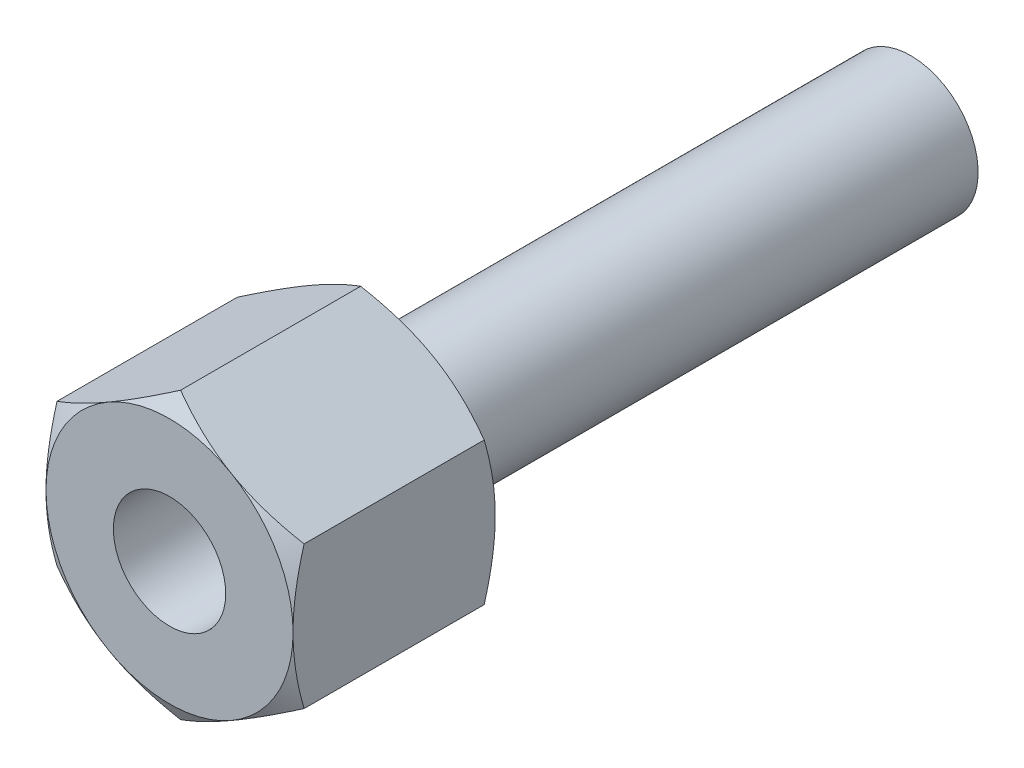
ISO-10303-21;
HEADER;
FILE_DESCRIPTION(('STEP AP214'),'2;1');
FILE_NAME('part.step','',(''),(''),'','','');
FILE_SCHEMA(('AUTOMOTIVE_DESIGN { 1 0 10303 214 1 1 1 1 }'));
ENDSEC;
DATA;
#1=APPLICATION_CONTEXT('core data for automotive mechanical design processes');
#2=APPLICATION_PROTOCOL_DEFINITION('international standard','automotive_design',2000,#1);
#3=PRODUCT_CONTEXT('',#1,'mechanical');
#4=PRODUCT('Part','Part','',(#3));
#5=PRODUCT_RELATED_PRODUCT_CATEGORY('part','',(#4));
#6=PRODUCT_DEFINITION_FORMATION('','',#4);
#7=PRODUCT_DEFINITION_CONTEXT('part definition',#1,'design');
#8=PRODUCT_DEFINITION('design','',#6,#7);
#9=PRODUCT_DEFINITION_SHAPE('','',#8);
#10=(LENGTH_UNIT() NAMED_UNIT(*) SI_UNIT(.MILLI.,.METRE.));
#11=(NAMED_UNIT(*) PLANE_ANGLE_UNIT() SI_UNIT($,.RADIAN.));
#12=(NAMED_UNIT(*) SI_UNIT($,.STERADIAN.) SOLID_ANGLE_UNIT());
#13=UNCERTAINTY_MEASURE_WITH_UNIT(LENGTH_MEASURE(1.E-05),#10,'distance_accuracy_value','');
#14=(GEOMETRIC_REPRESENTATION_CONTEXT(3) GLOBAL_UNCERTAINTY_ASSIGNED_CONTEXT((#13)) GLOBAL_UNIT_ASSIGNED_CONTEXT((#10,
#11,#12)) REPRESENTATION_CONTEXT('',''));
#15=CARTESIAN_POINT('',(0.,0.,0.));
#16=DIRECTION('',(0.,0.,1.));
#17=DIRECTION('',(1.,0.,0.));
#18=AXIS2_PLACEMENT_3D('',#15,#16,#17);
#19=CARTESIAN_POINT('',(0.,12.7017059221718,18.));
#20=DIRECTION('',(0.5,-0.866025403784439,0.));
#21=DIRECTION('',(0.866025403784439,0.5,0.));
#22=AXIS2_PLACEMENT_3D('',#19,#20,#21);
#23=PLANE('',#22);
#24=CARTESIAN_POINT('',(-11.0002,6.35073749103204,0.982547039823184));
#25=CARTESIAN_POINT('',(-10.7583962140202,6.49034297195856,0.901959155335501));
#26=CARTESIAN_POINT('',(-10.515690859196,6.63046897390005,0.825028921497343));
#27=CARTESIAN_POINT('',(-10.0283338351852,6.91184468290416,0.679498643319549));
#28=CARTESIAN_POINT('',(-9.78368155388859,7.05309474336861,0.610901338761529));
#29=CARTESIAN_POINT('',(-9.0457826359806,7.47912088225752,0.418936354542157));
#30=CARTESIAN_POINT('',(-8.54962304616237,7.76557875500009,0.309747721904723));
#31=CARTESIAN_POINT('',(-7.80714296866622,8.19424982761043,0.181714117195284));
#32=CARTESIAN_POINT('',(-7.56304065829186,8.33518236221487,0.145242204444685));
#33=CARTESIAN_POINT('',(-7.07370581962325,8.61769996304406,0.0840813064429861));
#34=CARTESIAN_POINT('',(-6.82847326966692,8.7592850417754,0.0593925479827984));
#35=CARTESIAN_POINT('',(-6.33759931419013,9.0426912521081,0.0224303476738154));
#36=CARTESIAN_POINT('',(-6.0919587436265,9.1845119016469,0.0101421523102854));
#37=CARTESIAN_POINT('',(-5.60044998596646,9.46828461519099,-0.00175707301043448));
#38=CARTESIAN_POINT('',(-5.35458180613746,9.61023667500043,-0.00136849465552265));
#39=CARTESIAN_POINT('',(-4.89492981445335,9.87561687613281,0.0112011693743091));
#40=CARTESIAN_POINT('',(-4.68111322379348,9.99906394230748,0.0218490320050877));
#41=CARTESIAN_POINT('',(-4.25397181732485,10.2456741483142,0.0525316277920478));
#42=CARTESIAN_POINT('',(-4.04064703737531,10.3688372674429,0.0725670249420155));
#43=CARTESIAN_POINT('',(-3.6146051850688,10.6148126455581,0.121675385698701));
#44=CARTESIAN_POINT('',(-3.4018887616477,10.7376245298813,0.150755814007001));
#45=CARTESIAN_POINT('',(-2.97745318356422,10.9826725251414,0.217443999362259));
#46=CARTESIAN_POINT('',(-2.76573409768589,11.1049085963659,0.255052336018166));
#47=CARTESIAN_POINT('',(-2.12304886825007,11.4759630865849,0.381619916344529));
#48=CARTESIAN_POINT('',(-1.69394387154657,11.7237069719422,0.48319945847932));
#49=CARTESIAN_POINT('',(-0.842132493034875,12.2155005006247,0.713743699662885));
#50=CARTESIAN_POINT('',(-0.419415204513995,12.4595564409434,0.842654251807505));
#51=CARTESIAN_POINT('',(0.00020000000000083,12.7018213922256,0.982547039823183));
#52=B_SPLINE_CURVE_WITH_KNOTS('',3,(#24,#25,#26,#27,#28,#29,#30,#31,#32,#33,#34,#35,#36,#37,#38,
#39,#40,#41,#42,#43,#44,#45,#46,#47,#48,#49,#50,#51),.UNSPECIFIED.,.F.,.F.,(4,2,2,2,2,2,2,2,2,2,
2,2,2,4),(0.,0.87175512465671,1.74379610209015,3.49159027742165,4.34403665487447,
5.19649943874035,6.04794680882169,6.89936787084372,7.64056020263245,8.38180496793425,
9.12366309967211,9.86557166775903,11.3820155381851,12.8954827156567),.UNSPECIFIED.);
#53=CARTESIAN_POINT('',(-11.,6.35085296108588,0.982480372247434));
#54=VERTEX_POINT('',#53);
#55=CARTESIAN_POINT('',(-5.5,9.52627944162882,0.));
#56=VERTEX_POINT('',#55);
#57=EDGE_CURVE('E319',#54,#56,#52,.T.);
#58=ORIENTED_EDGE('',*,*,#57,.F.);
#59=DIRECTION('',(0.,0.,-1.));
#60=VECTOR('',#59,1.);
#61=CARTESIAN_POINT('',(-11.,6.35085296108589,18.));
#62=LINE('',#61,#60);
#63=CARTESIAN_POINT('',(-11.,6.35085296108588,17.0175196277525));
#64=VERTEX_POINT('',#63);
#65=EDGE_CURVE('E239',#64,#54,#62,.T.);
#66=ORIENTED_EDGE('',*,*,#65,.F.);
#67=CARTESIAN_POINT('',(0.0002,12.7018213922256,17.0174529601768));
#68=CARTESIAN_POINT('',(-0.241603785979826,12.5622159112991,17.0980408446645));
#69=CARTESIAN_POINT('',(-0.484309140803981,12.4220899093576,17.1749710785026));
#70=CARTESIAN_POINT('',(-0.971666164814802,12.1407142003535,17.3205013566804));
#71=CARTESIAN_POINT('',(-1.21631844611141,11.999464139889,17.3890986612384));
#72=CARTESIAN_POINT('',(-1.95421736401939,11.5734380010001,17.5810636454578));
#73=CARTESIAN_POINT('',(-2.45037695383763,11.2869801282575,17.6902522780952));
#74=CARTESIAN_POINT('',(-3.19285703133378,10.8583090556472,17.8182858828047));
#75=CARTESIAN_POINT('',(-3.43695934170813,10.7173765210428,17.8547577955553));
#76=CARTESIAN_POINT('',(-3.92629418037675,10.4348589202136,17.915918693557));
#77=CARTESIAN_POINT('',(-4.17152673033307,10.2932738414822,17.9406074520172));
#78=CARTESIAN_POINT('',(-4.66240068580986,10.0098676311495,17.9775696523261));
#79=CARTESIAN_POINT('',(-4.90804125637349,9.86804698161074,17.9898578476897));
#80=CARTESIAN_POINT('',(-5.39955001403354,9.58427426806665,18.0017570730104));
#81=CARTESIAN_POINT('',(-5.64541819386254,9.44232220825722,18.0013684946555));
#82=CARTESIAN_POINT('',(-6.10507018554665,9.17694200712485,17.9887988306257));
#83=CARTESIAN_POINT('',(-6.31888677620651,9.05349494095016,17.9781509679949));
#84=CARTESIAN_POINT('',(-6.74602818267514,8.80688473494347,17.9474683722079));
#85=CARTESIAN_POINT('',(-6.95935296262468,8.68372161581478,17.9274329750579));
#86=CARTESIAN_POINT('',(-7.38539481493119,8.43774623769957,17.8783246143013));
#87=CARTESIAN_POINT('',(-7.59811123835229,8.31493435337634,17.849244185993));
#88=CARTESIAN_POINT('',(-8.02254681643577,8.06988635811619,17.7825560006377));
#89=CARTESIAN_POINT('',(-8.23426590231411,7.94765028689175,17.7449476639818));
#90=CARTESIAN_POINT('',(-8.87695113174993,7.57659579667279,17.6183800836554));
#91=CARTESIAN_POINT('',(-9.30605612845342,7.32885191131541,17.5168005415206));
#92=CARTESIAN_POINT('',(-10.1578675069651,6.8370583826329,17.2862563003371));
#93=CARTESIAN_POINT('',(-10.580584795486,6.59300244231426,17.1573457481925));
#94=CARTESIAN_POINT('',(-11.0002,6.35073749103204,17.0174529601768));
#95=B_SPLINE_CURVE_WITH_KNOTS('',3,(#67,#68,#69,#70,#71,#72,#73,#74,#75,#76,#77,#78,#79,#80,#81,
#82,#83,#84,#85,#86,#87,#88,#89,#90,#91,#92,#93,#94),.UNSPECIFIED.,.F.,.F.,(4,2,2,2,2,2,2,2,2,2,
2,2,2,4),(0.,0.871755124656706,1.74379610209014,3.49159027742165,4.34403665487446,
5.19649943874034,6.04794680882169,6.89936787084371,7.64056020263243,8.38180496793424,
9.1236630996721,9.86557166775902,11.3820155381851,12.8954827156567),.UNSPECIFIED.);
#96=CARTESIAN_POINT('',(-5.5,9.52627944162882,18.));
#97=VERTEX_POINT('',#96);
#98=EDGE_CURVE('E301',#97,#64,#95,.T.);
#99=ORIENTED_EDGE('',*,*,#98,.F.);
#100=CARTESIAN_POINT('',(0.,12.7017059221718,17.0175196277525));
#101=VERTEX_POINT('',#100);
#102=EDGE_CURVE('E300',#101,#97,#95,.T.);
#103=ORIENTED_EDGE('',*,*,#102,.F.);
#104=DIRECTION('',(0.,0.,-1.));
#105=VECTOR('',#104,1.);
#106=CARTESIAN_POINT('',(0.,12.7017059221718,18.));
#107=LINE('',#106,#105);
#108=CARTESIAN_POINT('',(0.,12.7017059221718,0.982480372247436));
#109=VERTEX_POINT('',#108);
#110=EDGE_CURVE('E242',#101,#109,#107,.T.);
#111=ORIENTED_EDGE('',*,*,#110,.T.);
#112=EDGE_CURVE('E174',#56,#109,#52,.T.);
#113=ORIENTED_EDGE('',*,*,#112,.F.);
#114=EDGE_LOOP('',(#58,#66,#99,#103,#111,#113));
#115=FACE_BOUND('',#114,.T.);
#116=ADVANCED_FACE('F14',(#115),#23,.F.);
#117=CARTESIAN_POINT('',(-11.,6.35085296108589,18.));
#118=DIRECTION('',(1.,0.,0.));
#119=DIRECTION('',(0.,0.,-1.));
#120=AXIS2_PLACEMENT_3D('',#117,#118,#119);
#121=PLANE('',#120);
#122=CARTESIAN_POINT('',(-11.,-17.132436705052,5.40386789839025));
#123=CARTESIAN_POINT('',(-11.,-16.8919200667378,5.2870196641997));
#124=CARTESIAN_POINT('',(-11.,-16.6511231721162,5.17074857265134));
#125=CARTESIAN_POINT('',(-11.,-16.1689104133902,4.93949123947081));
#126=CARTESIAN_POINT('',(-11.,-15.9274945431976,4.8245050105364));
#127=CARTESIAN_POINT('',(-11.,-15.2021675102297,4.48163963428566));
#128=CARTESIAN_POINT('',(-11.,-14.7172469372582,4.255887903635));
#129=CARTESIAN_POINT('',(-11.,-13.7415811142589,3.81020890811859));
#130=CARTESIAN_POINT('',(-11.,-13.2508185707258,3.59031941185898));
#131=CARTESIAN_POINT('',(-11.,-12.2654163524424,3.159437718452));
#132=CARTESIAN_POINT('',(-11.,-11.7707768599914,2.94844510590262));
#133=CARTESIAN_POINT('',(-11.,-10.7605641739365,2.53098565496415));
#134=CARTESIAN_POINT('',(-11.,-10.2448356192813,2.32489283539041));
#135=CARTESIAN_POINT('',(-11.,-9.20736825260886,1.9281275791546));
#136=CARTESIAN_POINT('',(-11.,-8.68562877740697,1.73745686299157));
#137=CARTESIAN_POINT('',(-11.,-7.63627955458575,1.37649075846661));
#138=CARTESIAN_POINT('',(-11.,-7.10868389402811,1.2061547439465));
#139=CARTESIAN_POINT('',(-11.,-6.04587471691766,0.891265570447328));
#140=CARTESIAN_POINT('',(-11.,-5.51066363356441,0.746704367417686));
#141=CARTESIAN_POINT('',(-11.,-4.70352635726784,0.554786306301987));
#142=CARTESIAN_POINT('',(-11.,-4.43451468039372,0.495099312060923));
#143=CARTESIAN_POINT('',(-11.,-3.89463964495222,0.384736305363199));
#144=CARTESIAN_POINT('',(-11.,-3.62377632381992,0.334060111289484));
#145=CARTESIAN_POINT('',(-11.,-3.08037933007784,0.242608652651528));
#146=CARTESIAN_POINT('',(-11.,-2.80784568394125,0.201833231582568));
#147=CARTESIAN_POINT('',(-11.,-2.26139090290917,0.130993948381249));
#148=CARTESIAN_POINT('',(-11.,-1.98746982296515,0.100929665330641));
#149=CARTESIAN_POINT('',(-11.,-1.44223107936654,0.0524909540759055));
#150=CARTESIAN_POINT('',(-11.,-1.17092673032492,0.0339675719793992));
#151=CARTESIAN_POINT('',(-11.,-0.627778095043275,0.00841453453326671));
#152=CARTESIAN_POINT('',(-11.,-0.355933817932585,0.00138468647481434));
#153=CARTESIAN_POINT('',(-11.,0.187808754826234,-0.00101379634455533));
#154=CARTESIAN_POINT('',(-11.,0.4597070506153,0.00361759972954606));
#155=CARTESIAN_POINT('',(-11.,1.0030644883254,0.0244277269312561));
#156=CARTESIAN_POINT('',(-11.,1.27452360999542,0.040606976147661));
#157=CARTESIAN_POINT('',(-11.,1.9247225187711,0.0928443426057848));
#158=CARTESIAN_POINT('',(-11.,2.30303967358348,0.134259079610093));
#159=CARTESIAN_POINT('',(-11.,3.0569165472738,0.237279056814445));
#160=CARTESIAN_POINT('',(-11.,3.43247589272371,0.29888698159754));
#161=CARTESIAN_POINT('',(-11.,4.18046219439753,0.440101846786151));
#162=CARTESIAN_POINT('',(-11.,4.55288651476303,0.51972261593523));
#163=CARTESIAN_POINT('',(-11.,5.29402392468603,0.694529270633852));
#164=CARTESIAN_POINT('',(-11.,5.66273706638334,0.789714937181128));
#165=CARTESIAN_POINT('',(-11.,6.40459432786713,0.995589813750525));
#166=CARTESIAN_POINT('',(-11.,6.77765547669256,1.1065759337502));
#167=CARTESIAN_POINT('',(-11.,7.52010379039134,1.34016052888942));
#168=CARTESIAN_POINT('',(-11.,7.88949093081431,1.46275908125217));
#169=CARTESIAN_POINT('',(-11.,8.62477113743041,1.71760928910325));
#170=CARTESIAN_POINT('',(-11.,8.99066528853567,1.84985782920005));
#171=CARTESIAN_POINT('',(-11.,9.7194121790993,2.12243795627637));
#172=CARTESIAN_POINT('',(-11.,10.0822649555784,2.26276944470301));
#173=CARTESIAN_POINT('',(-11.,10.9437244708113,2.6052148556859));
#174=CARTESIAN_POINT('',(-11.,11.441105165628,2.81040851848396));
#175=CARTESIAN_POINT('',(-11.,12.4315776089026,3.23092856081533));
#176=CARTESIAN_POINT('',(-11.,12.924669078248,3.44625559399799));
#177=CARTESIAN_POINT('',(-11.,13.9073693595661,3.88499704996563));
#178=CARTESIAN_POINT('',(-11.,14.3969773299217,4.10841335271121));
#179=CARTESIAN_POINT('',(-11.,15.3731814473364,4.56168733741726));
#180=CARTESIAN_POINT('',(-11.,15.8597776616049,4.79154487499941));
#181=CARTESIAN_POINT('',(-11.,16.8310109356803,5.25675036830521));
#182=CARTESIAN_POINT('',(-11.,17.3156451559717,5.49210424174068));
#183=CARTESIAN_POINT('',(-11.,18.282804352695,5.96710598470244));
#184=CARTESIAN_POINT('',(-11.,18.7653293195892,6.20675387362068));
#185=CARTESIAN_POINT('',(-11.,19.7285315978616,6.68956960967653));
#186=CARTESIAN_POINT('',(-11.,20.2092091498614,6.9327369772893));
#187=CARTESIAN_POINT('',(-11.,21.1690502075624,7.42204336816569));
#188=CARTESIAN_POINT('',(-11.,21.6482137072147,7.66818240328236));
#189=CARTESIAN_POINT('',(-11.,23.0023717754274,8.36825740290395));
#190=CARTESIAN_POINT('',(-11.,23.8758527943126,8.82512094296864));
#191=CARTESIAN_POINT('',(-11.,25.619561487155,9.74507764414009));
#192=CARTESIAN_POINT('',(-11.,26.4897890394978,10.2081710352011));
#193=CARTESIAN_POINT('',(-11.,28.2254628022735,11.1379266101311));
#194=CARTESIAN_POINT('',(-11.,29.0909155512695,11.6045765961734));
#195=CARTESIAN_POINT('',(-11.,30.3875626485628,12.3073166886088));
#196=CARTESIAN_POINT('',(-11.,30.819510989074,12.542017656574));
#197=CARTESIAN_POINT('',(-11.,31.6829552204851,13.0122488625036));
#198=CARTESIAN_POINT('',(-11.,32.1144511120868,13.2477790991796));
#199=CARTESIAN_POINT('',(-11.,32.5457465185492,13.4836759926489));
#200=B_SPLINE_CURVE_WITH_KNOTS('',3,(#122,#123,#124,#125,#126,#127,#128,#129,#130,#131,#132,
#133,#134,#135,#136,#137,#138,#139,#140,#141,#142,#143,#144,#145,#146,#147,#148,#149,#150,#151,
#152,#153,#154,#155,#156,#157,#158,#159,#160,#161,#162,#163,#164,#165,#166,#167,#168,#169,#170,
#171,#172,#173,#174,#175,#176,#177,#178,#179,#180,#181,#182,#183,#184,#185,#186,#187,#188,#189,
#190,#191,#192,#193,#194,#195,#196,#197,#198,#199),.UNSPECIFIED.,.F.,.F.,(4,2,2,2,2,2,2,2,2,2,2,
2,2,2,2,2,2,2,2,2,2,2,2,2,2,2,2,2,2,2,2,2,2,2,2,2,2,2,4),(0.,0.802192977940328,1.60439387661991,
3.20902929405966,4.82227795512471,6.43545120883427,8.10141163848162,9.76755766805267,
11.4303171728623,13.0925568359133,13.9190913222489,14.7456091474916,15.5721139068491,
16.3985861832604,17.2141576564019,18.0297154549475,18.8452754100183,19.6608719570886,
20.801973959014,21.9432277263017,23.0853606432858,24.2274774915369,25.3949131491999,
26.5623565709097,27.7294247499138,28.8964787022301,30.5104593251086,32.1245442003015,
33.739006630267,35.3534329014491,36.9696857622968,38.5859459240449,40.2019879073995,
41.8180363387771,44.7752334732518,47.7325400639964,50.6822626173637,52.1570416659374,
53.6318184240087),.UNSPECIFIED.);
#201=CARTESIAN_POINT('',(-11.,-6.35085296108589,0.982480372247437));
#202=VERTEX_POINT('',#201);
#203=CARTESIAN_POINT('',(-11.,0.,0.));
#204=VERTEX_POINT('',#203);
#205=EDGE_CURVE('E115',#202,#204,#200,.T.);
#206=ORIENTED_EDGE('',*,*,#205,.F.);
#207=DIRECTION('',(0.,0.,-1.));
#208=VECTOR('',#207,1.);
#209=CARTESIAN_POINT('',(-11.,-6.35085296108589,18.));
#210=LINE('',#209,#208);
#211=CARTESIAN_POINT('',(-11.,-6.35085296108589,17.0175196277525));
#212=VERTEX_POINT('',#211);
#213=EDGE_CURVE('E139',#212,#202,#210,.T.);
#214=ORIENTED_EDGE('',*,*,#213,.F.);
#215=CARTESIAN_POINT('',(-11.,-17.132436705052,12.5961321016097));
#216=CARTESIAN_POINT('',(-11.,-16.8919200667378,12.7129803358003));
#217=CARTESIAN_POINT('',(-11.,-16.6511231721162,12.8292514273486));
#218=CARTESIAN_POINT('',(-11.,-16.1689104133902,13.0605087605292));
#219=CARTESIAN_POINT('',(-11.,-15.9274945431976,13.1754949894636));
#220=CARTESIAN_POINT('',(-11.,-15.2021675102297,13.5183603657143));
#221=CARTESIAN_POINT('',(-11.,-14.7172469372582,13.744112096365));
#222=CARTESIAN_POINT('',(-11.,-13.7415811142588,14.1897910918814));
#223=CARTESIAN_POINT('',(-11.,-13.2508185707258,14.409680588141));
#224=CARTESIAN_POINT('',(-11.,-12.2654163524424,14.840562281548));
#225=CARTESIAN_POINT('',(-11.,-11.7707768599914,15.0515548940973));
#226=CARTESIAN_POINT('',(-11.,-10.7605641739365,15.4690143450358));
#227=CARTESIAN_POINT('',(-11.,-10.2448356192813,15.6751071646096));
#228=CARTESIAN_POINT('',(-11.,-9.20736825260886,16.0718724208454));
#229=CARTESIAN_POINT('',(-11.,-8.68562877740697,16.2625431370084));
#230=CARTESIAN_POINT('',(-11.,-7.63627955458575,16.6235092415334));
#231=CARTESIAN_POINT('',(-11.,-7.10868389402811,16.7938452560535));
#232=CARTESIAN_POINT('',(-11.,-6.04587471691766,17.1087344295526));
#233=CARTESIAN_POINT('',(-11.,-5.51066363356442,17.2532956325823));
#234=CARTESIAN_POINT('',(-11.,-4.70352635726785,17.445213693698));
#235=CARTESIAN_POINT('',(-11.,-4.43451468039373,17.504900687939));
#236=CARTESIAN_POINT('',(-11.,-3.89463964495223,17.6152636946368));
#237=CARTESIAN_POINT('',(-11.,-3.62377632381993,17.6659398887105));
#238=CARTESIAN_POINT('',(-11.,-3.08037933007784,17.7573913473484));
#239=CARTESIAN_POINT('',(-11.,-2.80784568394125,17.7981667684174));
#240=CARTESIAN_POINT('',(-11.,-2.26139090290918,17.8690060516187));
#241=CARTESIAN_POINT('',(-11.,-1.98746982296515,17.8990703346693));
#242=CARTESIAN_POINT('',(-11.,-1.44223107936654,17.9475090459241));
#243=CARTESIAN_POINT('',(-11.,-1.17092673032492,17.9660324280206));
#244=CARTESIAN_POINT('',(-11.,-0.627778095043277,17.9915854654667));
#245=CARTESIAN_POINT('',(-11.,-0.355933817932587,17.9986153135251));
#246=CARTESIAN_POINT('',(-11.,0.187808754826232,18.0010137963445));
#247=CARTESIAN_POINT('',(-11.,0.459707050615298,17.9963824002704));
#248=CARTESIAN_POINT('',(-11.,1.0030644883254,17.9755722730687));
#249=CARTESIAN_POINT('',(-11.,1.27452360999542,17.9593930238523));
#250=CARTESIAN_POINT('',(-11.,1.9247225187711,17.9071556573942));
#251=CARTESIAN_POINT('',(-11.,2.30303967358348,17.8657409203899));
#252=CARTESIAN_POINT('',(-11.,3.05691654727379,17.7627209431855));
#253=CARTESIAN_POINT('',(-11.,3.4324758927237,17.7011130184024));
#254=CARTESIAN_POINT('',(-11.,4.18046219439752,17.5598981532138));
#255=CARTESIAN_POINT('',(-11.,4.55288651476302,17.4802773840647));
#256=CARTESIAN_POINT('',(-11.,5.29402392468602,17.3054707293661));
#257=CARTESIAN_POINT('',(-11.,5.66273706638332,17.2102850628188));
#258=CARTESIAN_POINT('',(-11.,6.40459432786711,17.0044101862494));
#259=CARTESIAN_POINT('',(-11.,6.77765547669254,16.8934240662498));
#260=CARTESIAN_POINT('',(-11.,7.52010379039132,16.6598394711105));
#261=CARTESIAN_POINT('',(-11.,7.88949093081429,16.5372409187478));
#262=CARTESIAN_POINT('',(-11.,8.62477113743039,16.2823907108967));
#263=CARTESIAN_POINT('',(-11.,8.99066528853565,16.1501421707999));
#264=CARTESIAN_POINT('',(-11.,9.71941217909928,15.8775620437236));
#265=CARTESIAN_POINT('',(-11.,10.0822649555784,15.737230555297));
#266=CARTESIAN_POINT('',(-11.,10.9437244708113,15.3947851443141));
#267=CARTESIAN_POINT('',(-11.,11.441105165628,15.189591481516));
#268=CARTESIAN_POINT('',(-11.,12.4315776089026,14.7690714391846));
#269=CARTESIAN_POINT('',(-11.,12.924669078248,14.553744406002));
#270=CARTESIAN_POINT('',(-11.,13.9073693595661,14.1150029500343));
#271=CARTESIAN_POINT('',(-11.,14.3969773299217,13.8915866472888));
#272=CARTESIAN_POINT('',(-11.,15.3731814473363,13.4383126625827));
#273=CARTESIAN_POINT('',(-11.,15.8597776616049,13.2084551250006));
#274=CARTESIAN_POINT('',(-11.,16.8310109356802,12.7432496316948));
#275=CARTESIAN_POINT('',(-11.,17.3156451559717,12.5078957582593));
#276=CARTESIAN_POINT('',(-11.,18.282804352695,12.0328940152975));
#277=CARTESIAN_POINT('',(-11.,18.7653293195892,11.7932461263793));
#278=CARTESIAN_POINT('',(-11.,19.7285315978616,11.3104303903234));
#279=CARTESIAN_POINT('',(-11.,20.2092091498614,11.0672630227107));
#280=CARTESIAN_POINT('',(-11.,21.1690502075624,10.5779566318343));
#281=CARTESIAN_POINT('',(-11.,21.6482137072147,10.3318175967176));
#282=CARTESIAN_POINT('',(-11.,23.0023717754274,9.63174259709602));
#283=CARTESIAN_POINT('',(-11.,23.8758527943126,9.17487905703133));
#284=CARTESIAN_POINT('',(-11.,25.619561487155,8.25492235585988));
#285=CARTESIAN_POINT('',(-11.,26.4897890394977,7.79182896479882));
#286=CARTESIAN_POINT('',(-11.,28.2254628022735,6.86207338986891));
#287=CARTESIAN_POINT('',(-11.,29.0909155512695,6.39542340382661));
#288=CARTESIAN_POINT('',(-11.,30.3875626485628,5.69268331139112));
#289=CARTESIAN_POINT('',(-11.,30.819510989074,5.45798234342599));
#290=CARTESIAN_POINT('',(-11.,31.6829552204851,4.98775113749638));
#291=CARTESIAN_POINT('',(-11.,32.1144511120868,4.75222090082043));
#292=CARTESIAN_POINT('',(-11.,32.5457465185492,4.51632400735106));
#293=B_SPLINE_CURVE_WITH_KNOTS('',3,(#215,#216,#217,#218,#219,#220,#221,#222,#223,#224,#225,
#226,#227,#228,#229,#230,#231,#232,#233,#234,#235,#236,#237,#238,#239,#240,#241,#242,#243,#244,
#245,#246,#247,#248,#249,#250,#251,#252,#253,#254,#255,#256,#257,#258,#259,#260,#261,#262,#263,
#264,#265,#266,#267,#268,#269,#270,#271,#272,#273,#274,#275,#276,#277,#278,#279,#280,#281,#282,
#283,#284,#285,#286,#287,#288,#289,#290,#291,#292),.UNSPECIFIED.,.F.,.F.,(4,2,2,2,2,2,2,2,2,2,2,
2,2,2,2,2,2,2,2,2,2,2,2,2,2,2,2,2,2,2,2,2,2,2,2,2,2,2,4),(0.,0.802192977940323,1.60439387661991,
3.20902929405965,4.82227795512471,6.43545120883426,8.10141163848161,9.76755766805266,
11.4303171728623,13.0925568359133,13.9190913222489,14.7456091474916,15.5721139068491,
16.3985861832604,17.2141576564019,18.0297154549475,18.8452754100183,19.6608719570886,
20.801973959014,21.9432277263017,23.0853606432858,24.2274774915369,25.3949131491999,
26.5623565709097,27.7294247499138,28.8964787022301,30.5104593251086,32.1245442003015,
33.739006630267,35.3534329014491,36.9696857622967,38.5859459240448,40.2019879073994,
41.8180363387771,44.7752334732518,47.7325400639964,50.6822626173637,52.1570416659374,
53.6318184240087),.UNSPECIFIED.);
#294=CARTESIAN_POINT('',(-11.,0.,18.));
#295=VERTEX_POINT('',#294);
#296=EDGE_CURVE('E207',#295,#212,#293,.F.);
#297=ORIENTED_EDGE('',*,*,#296,.F.);
#298=EDGE_CURVE('E286',#64,#295,#293,.F.);
#299=ORIENTED_EDGE('',*,*,#298,.F.);
#300=ORIENTED_EDGE('',*,*,#65,.T.);
#301=EDGE_CURVE('E133',#204,#54,#200,.T.);
#302=ORIENTED_EDGE('',*,*,#301,.F.);
#303=EDGE_LOOP('',(#206,#214,#297,#299,#300,#302));
#304=FACE_BOUND('',#303,.T.);
#305=ADVANCED_FACE('F193',(#304),#121,.F.);
#306=CARTESIAN_POINT('',(-11.,-6.35085296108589,18.));
#307=DIRECTION('',(0.5,0.866025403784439,0.));
#308=DIRECTION('',(-0.866025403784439,0.5,0.));
#309=AXIS2_PLACEMENT_3D('',#306,#307,#308);
#310=PLANE('',#309);
#311=CARTESIAN_POINT('',(0.000199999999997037,-12.7018213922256,0.982547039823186));
#312=CARTESIAN_POINT('',(-0.24160378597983,-12.5622159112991,0.901959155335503));
#313=CARTESIAN_POINT('',(-0.484309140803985,-12.4220899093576,0.825028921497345));
#314=CARTESIAN_POINT('',(-0.971666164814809,-12.1407142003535,0.679498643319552));
#315=CARTESIAN_POINT('',(-1.21631844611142,-11.999464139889,0.610901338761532));
#316=CARTESIAN_POINT('',(-1.9542173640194,-11.5734380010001,0.418936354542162));
#317=CARTESIAN_POINT('',(-2.45037695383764,-11.2869801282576,0.309747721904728));
#318=CARTESIAN_POINT('',(-3.19285703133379,-10.8583090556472,0.181714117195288));
#319=CARTESIAN_POINT('',(-3.43695934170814,-10.7173765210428,0.145242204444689));
#320=CARTESIAN_POINT('',(-3.92629418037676,-10.4348589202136,0.0840813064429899));
#321=CARTESIAN_POINT('',(-4.17152673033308,-10.2932738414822,0.0593925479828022));
#322=CARTESIAN_POINT('',(-4.66240068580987,-10.0098676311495,0.0224303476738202));
#323=CARTESIAN_POINT('',(-4.9080412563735,-9.86804698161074,0.0101421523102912));
#324=CARTESIAN_POINT('',(-5.39955001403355,-9.58427426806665,-0.00175707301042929));
#325=CARTESIAN_POINT('',(-5.64541819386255,-9.44232220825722,-0.00136849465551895));
#326=CARTESIAN_POINT('',(-6.10507018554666,-9.17694200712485,0.0112011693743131));
#327=CARTESIAN_POINT('',(-6.31888677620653,-9.05349494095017,0.0218490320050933));
#328=CARTESIAN_POINT('',(-6.74602818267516,-8.80688473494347,0.0525316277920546));
#329=CARTESIAN_POINT('',(-6.95935296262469,-8.68372161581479,0.0725670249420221));
#330=CARTESIAN_POINT('',(-7.3853948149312,-8.43774623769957,0.121675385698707));
#331=CARTESIAN_POINT('',(-7.59811123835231,-8.31493435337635,0.150755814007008));
#332=CARTESIAN_POINT('',(-8.02254681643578,-8.0698863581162,0.217443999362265));
#333=CARTESIAN_POINT('',(-8.23426590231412,-7.94765028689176,0.255052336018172));
#334=CARTESIAN_POINT('',(-8.87695113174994,-7.57659579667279,0.381619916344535));
#335=CARTESIAN_POINT('',(-9.30605612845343,-7.32885191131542,0.483199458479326));
#336=CARTESIAN_POINT('',(-10.1578675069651,-6.83705838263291,0.713743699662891));
#337=CARTESIAN_POINT('',(-10.580584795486,-6.59300244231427,0.842654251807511));
#338=CARTESIAN_POINT('',(-11.0002,-6.35073749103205,0.982547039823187));
#339=B_SPLINE_CURVE_WITH_KNOTS('',3,(#311,#312,#313,#314,#315,#316,#317,#318,#319,#320,#321,
#322,#323,#324,#325,#326,#327,#328,#329,#330,#331,#332,#333,#334,#335,#336,#337,#338),
.UNSPECIFIED.,.F.,.F.,(4,2,2,2,2,2,2,2,2,2,2,2,2,4),(0.,0.871755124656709,1.74379610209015,
3.49159027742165,4.34403665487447,5.19649943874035,6.0479468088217,6.89936787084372,
7.64056020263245,8.38180496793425,9.1236630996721,9.86557166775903,11.3820155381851,
12.8954827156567),.UNSPECIFIED.);
#340=CARTESIAN_POINT('',(0.,-12.7017059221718,0.982480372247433));
#341=VERTEX_POINT('',#340);
#342=CARTESIAN_POINT('',(-5.5,-9.52627944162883,0.));
#343=VERTEX_POINT('',#342);
#344=EDGE_CURVE('E125',#341,#343,#339,.T.);
#345=ORIENTED_EDGE('',*,*,#344,.F.);
#346=DIRECTION('',(0.,0.,-1.));
#347=VECTOR('',#346,1.);
#348=CARTESIAN_POINT('',(0.,-12.7017059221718,18.));
#349=LINE('',#348,#347);
#350=CARTESIAN_POINT('',(0.,-12.7017059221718,17.0175196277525));
#351=VERTEX_POINT('',#350);
#352=EDGE_CURVE('E236',#351,#341,#349,.T.);
#353=ORIENTED_EDGE('',*,*,#352,.F.);
#354=CARTESIAN_POINT('',(-11.0002,-6.35073749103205,17.0174529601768));
#355=CARTESIAN_POINT('',(-10.7583962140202,-6.49034297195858,17.0980408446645));
#356=CARTESIAN_POINT('',(-10.515690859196,-6.63046897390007,17.1749710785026));
#357=CARTESIAN_POINT('',(-10.0283338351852,-6.91184468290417,17.3205013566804));
#358=CARTESIAN_POINT('',(-9.78368155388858,-7.05309474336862,17.3890986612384));
#359=CARTESIAN_POINT('',(-9.0457826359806,-7.47912088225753,17.5810636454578));
#360=CARTESIAN_POINT('',(-8.54962304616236,-7.76557875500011,17.6902522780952));
#361=CARTESIAN_POINT('',(-7.80714296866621,-8.19424982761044,17.8182858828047));
#362=CARTESIAN_POINT('',(-7.56304065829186,-8.33518236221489,17.8547577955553));
#363=CARTESIAN_POINT('',(-7.07370581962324,-8.61769996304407,17.915918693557));
#364=CARTESIAN_POINT('',(-6.82847326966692,-8.75928504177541,17.9406074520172));
#365=CARTESIAN_POINT('',(-6.33759931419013,-9.04269125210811,17.9775696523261));
#366=CARTESIAN_POINT('',(-6.0919587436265,-9.18451190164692,17.9898578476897));
#367=CARTESIAN_POINT('',(-5.60044998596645,-9.46828461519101,18.0017570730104));
#368=CARTESIAN_POINT('',(-5.35458180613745,-9.61023667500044,18.0013684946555));
#369=CARTESIAN_POINT('',(-4.89492981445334,-9.87561687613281,17.9887988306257));
#370=CARTESIAN_POINT('',(-4.68111322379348,-9.99906394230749,17.9781509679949));
#371=CARTESIAN_POINT('',(-4.25397181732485,-10.2456741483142,17.9474683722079));
#372=CARTESIAN_POINT('',(-4.04064703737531,-10.3688372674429,17.9274329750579));
#373=CARTESIAN_POINT('',(-3.6146051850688,-10.6148126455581,17.8783246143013));
#374=CARTESIAN_POINT('',(-3.4018887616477,-10.7376245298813,17.849244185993));
#375=CARTESIAN_POINT('',(-2.97745318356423,-10.9826725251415,17.7825560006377));
#376=CARTESIAN_POINT('',(-2.76573409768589,-11.1049085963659,17.7449476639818));
#377=CARTESIAN_POINT('',(-2.12304886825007,-11.4759630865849,17.6183800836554));
#378=CARTESIAN_POINT('',(-1.69394387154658,-11.7237069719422,17.5168005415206));
#379=CARTESIAN_POINT('',(-0.842132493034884,-12.2155005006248,17.2862563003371));
#380=CARTESIAN_POINT('',(-0.419415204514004,-12.4595564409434,17.1573457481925));
#381=CARTESIAN_POINT('',(0.000199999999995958,-12.7018213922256,17.0174529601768));
#382=B_SPLINE_CURVE_WITH_KNOTS('',3,(#354,#355,#356,#357,#358,#359,#360,#361,#362,#363,#364,
#365,#366,#367,#368,#369,#370,#371,#372,#373,#374,#375,#376,#377,#378,#379,#380,#381),
.UNSPECIFIED.,.F.,.F.,(4,2,2,2,2,2,2,2,2,2,2,2,2,4),(0.,0.871755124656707,1.74379610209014,
3.49159027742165,4.34403665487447,5.19649943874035,6.0479468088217,6.89936787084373,
7.64056020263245,8.38180496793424,9.1236630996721,9.86557166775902,11.3820155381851,
12.8954827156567),.UNSPECIFIED.);
#383=CARTESIAN_POINT('',(-5.5,-9.52627944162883,18.));
#384=VERTEX_POINT('',#383);
#385=EDGE_CURVE('E208',#384,#351,#382,.T.);
#386=ORIENTED_EDGE('',*,*,#385,.F.);
#387=EDGE_CURVE('E198',#212,#384,#382,.T.);
#388=ORIENTED_EDGE('',*,*,#387,.F.);
#389=ORIENTED_EDGE('',*,*,#213,.T.);
#390=EDGE_CURVE('E113',#343,#202,#339,.T.);
#391=ORIENTED_EDGE('',*,*,#390,.F.);
#392=EDGE_LOOP('',(#345,#353,#386,#388,#389,#391));
#393=FACE_BOUND('',#392,.T.);
#394=ADVANCED_FACE('F136',(#393),#310,.F.);
#395=CARTESIAN_POINT('',(0.,-12.7017059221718,18.));
#396=DIRECTION('',(-0.5,0.866025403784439,0.));
#397=DIRECTION('',(-0.866025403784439,-0.5,0.));
#398=AXIS2_PLACEMENT_3D('',#395,#396,#397);
#399=PLANE('',#398);
#400=CARTESIAN_POINT('',(11.0002,-6.35073749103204,0.982547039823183));
#401=CARTESIAN_POINT('',(10.7583962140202,-6.49034297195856,0.901959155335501));
#402=CARTESIAN_POINT('',(10.515690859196,-6.63046897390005,0.825028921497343));
#403=CARTESIAN_POINT('',(10.0283338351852,-6.91184468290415,0.679498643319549));
#404=CARTESIAN_POINT('',(9.78368155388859,-7.05309474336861,0.61090133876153));
#405=CARTESIAN_POINT('',(9.04578263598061,-7.47912088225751,0.418936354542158));
#406=CARTESIAN_POINT('',(8.54962304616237,-7.76557875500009,0.309747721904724));
#407=CARTESIAN_POINT('',(7.80714296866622,-8.19424982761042,0.181714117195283));
#408=CARTESIAN_POINT('',(7.56304065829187,-8.33518236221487,0.145242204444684));
#409=CARTESIAN_POINT('',(7.07370581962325,-8.61769996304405,0.0840813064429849));
#410=CARTESIAN_POINT('',(6.82847326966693,-8.75928504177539,0.0593925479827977));
#411=CARTESIAN_POINT('',(6.33759931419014,-9.0426912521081,0.0224303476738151));
#412=CARTESIAN_POINT('',(6.09195874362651,-9.1845119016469,0.0101421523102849));
#413=CARTESIAN_POINT('',(5.60044998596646,-9.46828461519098,-0.00175707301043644));
#414=CARTESIAN_POINT('',(5.35458180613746,-9.61023667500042,-0.00136849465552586));
#415=CARTESIAN_POINT('',(4.89492981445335,-9.8756168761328,0.0112011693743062));
#416=CARTESIAN_POINT('',(4.68111322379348,-9.99906394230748,0.0218490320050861));
#417=CARTESIAN_POINT('',(4.25397181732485,-10.2456741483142,0.0525316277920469));
#418=CARTESIAN_POINT('',(4.04064703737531,-10.3688372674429,0.0725670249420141));
#419=CARTESIAN_POINT('',(3.6146051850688,-10.6148126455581,0.121675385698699));
#420=CARTESIAN_POINT('',(3.4018887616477,-10.7376245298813,0.150755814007));
#421=CARTESIAN_POINT('',(2.97745318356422,-10.9826725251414,0.217443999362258));
#422=CARTESIAN_POINT('',(2.76573409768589,-11.1049085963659,0.255052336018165));
#423=CARTESIAN_POINT('',(2.12304886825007,-11.4759630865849,0.381619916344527));
#424=CARTESIAN_POINT('',(1.69394387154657,-11.7237069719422,0.483199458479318));
#425=CARTESIAN_POINT('',(0.842132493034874,-12.2155005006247,0.713743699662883));
#426=CARTESIAN_POINT('',(0.419415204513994,-12.4595564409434,0.842654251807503));
#427=CARTESIAN_POINT('',(-0.000200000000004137,-12.7018213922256,0.982547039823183));
#428=B_SPLINE_CURVE_WITH_KNOTS('',3,(#400,#401,#402,#403,#404,#405,#406,#407,#408,#409,#410,
#411,#412,#413,#414,#415,#416,#417,#418,#419,#420,#421,#422,#423,#424,#425,#426,#427),
.UNSPECIFIED.,.F.,.F.,(4,2,2,2,2,2,2,2,2,2,2,2,2,4),(0.,0.871755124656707,1.74379610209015,
3.49159027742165,4.34403665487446,5.19649943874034,6.04794680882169,6.89936787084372,
7.64056020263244,8.38180496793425,9.12366309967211,9.86557166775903,11.3820155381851,
12.8954827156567),.UNSPECIFIED.);
#429=CARTESIAN_POINT('',(11.,-6.35085296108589,0.982480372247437));
#430=VERTEX_POINT('',#429);
#431=CARTESIAN_POINT('',(5.5,-9.52627944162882,0.));
#432=VERTEX_POINT('',#431);
#433=EDGE_CURVE('E153',#430,#432,#428,.T.);
#434=ORIENTED_EDGE('',*,*,#433,.F.);
#435=DIRECTION('',(0.,0.,-1.));
#436=VECTOR('',#435,1.);
#437=CARTESIAN_POINT('',(11.,-6.35085296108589,18.));
#438=LINE('',#437,#436);
#439=CARTESIAN_POINT('',(11.,-6.35085296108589,17.0175196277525));
#440=VERTEX_POINT('',#439);
#441=EDGE_CURVE('E233',#440,#430,#438,.T.);
#442=ORIENTED_EDGE('',*,*,#441,.F.);
#443=CARTESIAN_POINT('',(-0.000200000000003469,-12.7018213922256,17.0174529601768));
#444=CARTESIAN_POINT('',(0.241603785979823,-12.5622159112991,17.0980408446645));
#445=CARTESIAN_POINT('',(0.484309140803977,-12.4220899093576,17.1749710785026));
#446=CARTESIAN_POINT('',(0.971666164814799,-12.1407142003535,17.3205013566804));
#447=CARTESIAN_POINT('',(1.21631844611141,-11.999464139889,17.3890986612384));
#448=CARTESIAN_POINT('',(1.95421736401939,-11.5734380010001,17.5810636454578));
#449=CARTESIAN_POINT('',(2.45037695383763,-11.2869801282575,17.6902522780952));
#450=CARTESIAN_POINT('',(3.19285703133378,-10.8583090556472,17.8182858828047));
#451=CARTESIAN_POINT('',(3.43695934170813,-10.7173765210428,17.8547577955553));
#452=CARTESIAN_POINT('',(3.92629418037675,-10.4348589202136,17.915918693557));
#453=CARTESIAN_POINT('',(4.17152673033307,-10.2932738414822,17.9406074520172));
#454=CARTESIAN_POINT('',(4.66240068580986,-10.0098676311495,17.9775696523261));
#455=CARTESIAN_POINT('',(4.90804125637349,-9.86804698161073,17.9898578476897));
#456=CARTESIAN_POINT('',(5.39955001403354,-9.58427426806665,18.0017570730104));
#457=CARTESIAN_POINT('',(5.64541819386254,-9.44232220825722,18.0013684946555));
#458=CARTESIAN_POINT('',(6.10507018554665,-9.17694200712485,17.9887988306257));
#459=CARTESIAN_POINT('',(6.31888677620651,-9.05349494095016,17.9781509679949));
#460=CARTESIAN_POINT('',(6.74602818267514,-8.80688473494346,17.9474683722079));
#461=CARTESIAN_POINT('',(6.95935296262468,-8.68372161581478,17.9274329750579));
#462=CARTESIAN_POINT('',(7.38539481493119,-8.43774623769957,17.8783246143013));
#463=CARTESIAN_POINT('',(7.59811123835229,-8.31493435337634,17.849244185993));
#464=CARTESIAN_POINT('',(8.02254681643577,-8.06988635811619,17.7825560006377));
#465=CARTESIAN_POINT('',(8.2342659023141,-7.94765028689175,17.7449476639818));
#466=CARTESIAN_POINT('',(8.87695113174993,-7.57659579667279,17.6183800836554));
#467=CARTESIAN_POINT('',(9.30605612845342,-7.32885191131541,17.5168005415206));
#468=CARTESIAN_POINT('',(10.1578675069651,-6.8370583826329,17.2862563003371));
#469=CARTESIAN_POINT('',(10.580584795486,-6.59300244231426,17.1573457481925));
#470=CARTESIAN_POINT('',(11.0002,-6.35073749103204,17.0174529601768));
#471=B_SPLINE_CURVE_WITH_KNOTS('',3,(#443,#444,#445,#446,#447,#448,#449,#450,#451,#452,#453,
#454,#455,#456,#457,#458,#459,#460,#461,#462,#463,#464,#465,#466,#467,#468,#469,#470),
.UNSPECIFIED.,.F.,.F.,(4,2,2,2,2,2,2,2,2,2,2,2,2,4),(0.,0.871755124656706,1.74379610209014,
3.49159027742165,4.34403665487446,5.19649943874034,6.04794680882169,6.89936787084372,
7.64056020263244,8.38180496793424,9.1236630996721,9.86557166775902,11.3820155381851,
12.8954827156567),.UNSPECIFIED.);
#472=CARTESIAN_POINT('',(5.5,-9.52627944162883,18.));
#473=VERTEX_POINT('',#472);
#474=EDGE_CURVE('E206',#473,#440,#471,.T.);
#475=ORIENTED_EDGE('',*,*,#474,.F.);
#476=EDGE_CURVE('E220',#351,#473,#471,.T.);
#477=ORIENTED_EDGE('',*,*,#476,.F.);
#478=ORIENTED_EDGE('',*,*,#352,.T.);
#479=EDGE_CURVE('E129',#432,#341,#428,.T.);
#480=ORIENTED_EDGE('',*,*,#479,.F.);
#481=EDGE_LOOP('',(#434,#442,#475,#477,#478,#480));
#482=FACE_BOUND('',#481,.T.);
#483=ADVANCED_FACE('F192',(#482),#399,.F.);
#484=CARTESIAN_POINT('',(11.,6.35085296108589,18.));
#485=DIRECTION('',(-0.5,-0.866025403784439,0.));
#486=DIRECTION('',(0.866025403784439,-0.5,0.));
#487=AXIS2_PLACEMENT_3D('',#484,#485,#486);
#488=PLANE('',#487);
#489=CARTESIAN_POINT('',(-0.0002,12.7018213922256,0.982547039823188));
#490=CARTESIAN_POINT('',(0.241603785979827,12.5622159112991,0.901959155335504));
#491=CARTESIAN_POINT('',(0.484309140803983,12.4220899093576,0.825028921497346));
#492=CARTESIAN_POINT('',(0.971666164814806,12.1407142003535,0.679498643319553));
#493=CARTESIAN_POINT('',(1.21631844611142,11.999464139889,0.610901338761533));
#494=CARTESIAN_POINT('',(1.9542173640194,11.5734380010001,0.418936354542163));
#495=CARTESIAN_POINT('',(2.45037695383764,11.2869801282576,0.309747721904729));
#496=CARTESIAN_POINT('',(3.19285703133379,10.8583090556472,0.181714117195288));
#497=CARTESIAN_POINT('',(3.43695934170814,10.7173765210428,0.145242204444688));
#498=CARTESIAN_POINT('',(3.92629418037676,10.4348589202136,0.0840813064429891));
#499=CARTESIAN_POINT('',(4.17152673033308,10.2932738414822,0.0593925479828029));
#500=CARTESIAN_POINT('',(4.66240068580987,10.0098676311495,0.0224303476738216));
#501=CARTESIAN_POINT('',(4.9080412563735,9.86804698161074,0.0101421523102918));
#502=CARTESIAN_POINT('',(5.39955001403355,9.58427426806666,-0.00175707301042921));
#503=CARTESIAN_POINT('',(5.64541819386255,9.44232220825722,-0.00136849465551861));
#504=CARTESIAN_POINT('',(6.10507018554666,9.17694200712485,0.0112011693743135));
#505=CARTESIAN_POINT('',(6.31888677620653,9.05349494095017,0.0218490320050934));
#506=CARTESIAN_POINT('',(6.74602818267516,8.80688473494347,0.0525316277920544));
#507=CARTESIAN_POINT('',(6.9593529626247,8.68372161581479,0.0725670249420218));
#508=CARTESIAN_POINT('',(7.38539481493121,8.43774623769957,0.121675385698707));
#509=CARTESIAN_POINT('',(7.59811123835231,8.31493435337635,0.150755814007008));
#510=CARTESIAN_POINT('',(8.02254681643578,8.0698863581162,0.217443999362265));
#511=CARTESIAN_POINT('',(8.23426590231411,7.94765028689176,0.255052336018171));
#512=CARTESIAN_POINT('',(8.87695113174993,7.57659579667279,0.381619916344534));
#513=CARTESIAN_POINT('',(9.30605612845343,7.32885191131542,0.483199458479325));
#514=CARTESIAN_POINT('',(10.1578675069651,6.83705838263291,0.71374369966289));
#515=CARTESIAN_POINT('',(10.580584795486,6.59300244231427,0.84265425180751));
#516=CARTESIAN_POINT('',(11.0002,6.35073749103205,0.982547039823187));
#517=B_SPLINE_CURVE_WITH_KNOTS('',3,(#489,#490,#491,#492,#493,#494,#495,#496,#497,#498,#499,
#500,#501,#502,#503,#504,#505,#506,#507,#508,#509,#510,#511,#512,#513,#514,#515,#516),
.UNSPECIFIED.,.F.,.F.,(4,2,2,2,2,2,2,2,2,2,2,2,2,4),(0.,0.87175512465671,1.74379610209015,
3.49159027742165,4.34403665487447,5.19649943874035,6.0479468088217,6.89936787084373,
7.64056020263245,8.38180496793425,9.1236630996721,9.86557166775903,11.3820155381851,
12.8954827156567),.UNSPECIFIED.);
#518=CARTESIAN_POINT('',(5.5,9.52627944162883,0.));
#519=VERTEX_POINT('',#518);
#520=EDGE_CURVE('E152',#109,#519,#517,.T.);
#521=ORIENTED_EDGE('',*,*,#520,.F.);
#522=ORIENTED_EDGE('',*,*,#110,.F.);
#523=CARTESIAN_POINT('',(11.0002,6.35073749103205,17.0174529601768));
#524=CARTESIAN_POINT('',(10.7583962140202,6.49034297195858,17.0980408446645));
#525=CARTESIAN_POINT('',(10.515690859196,6.63046897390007,17.1749710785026));
#526=CARTESIAN_POINT('',(10.0283338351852,6.91184468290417,17.3205013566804));
#527=CARTESIAN_POINT('',(9.78368155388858,7.05309474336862,17.3890986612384));
#528=CARTESIAN_POINT('',(9.0457826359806,7.47912088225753,17.5810636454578));
#529=CARTESIAN_POINT('',(8.54962304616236,7.76557875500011,17.6902522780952));
#530=CARTESIAN_POINT('',(7.80714296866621,8.19424982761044,17.8182858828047));
#531=CARTESIAN_POINT('',(7.56304065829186,8.33518236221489,17.8547577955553));
#532=CARTESIAN_POINT('',(7.07370581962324,8.61769996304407,17.915918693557));
#533=CARTESIAN_POINT('',(6.82847326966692,8.75928504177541,17.9406074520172));
#534=CARTESIAN_POINT('',(6.33759931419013,9.04269125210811,17.9775696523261));
#535=CARTESIAN_POINT('',(6.0919587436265,9.18451190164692,17.9898578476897));
#536=CARTESIAN_POINT('',(5.60044998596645,9.46828461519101,18.0017570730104));
#537=CARTESIAN_POINT('',(5.35458180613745,9.61023667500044,18.0013684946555));
#538=CARTESIAN_POINT('',(4.89492981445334,9.87561687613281,17.9887988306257));
#539=CARTESIAN_POINT('',(4.68111322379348,9.99906394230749,17.9781509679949));
#540=CARTESIAN_POINT('',(4.25397181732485,10.2456741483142,17.9474683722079));
#541=CARTESIAN_POINT('',(4.04064703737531,10.3688372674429,17.9274329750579));
#542=CARTESIAN_POINT('',(3.6146051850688,10.6148126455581,17.8783246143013));
#543=CARTESIAN_POINT('',(3.4018887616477,10.7376245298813,17.849244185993));
#544=CARTESIAN_POINT('',(2.97745318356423,10.9826725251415,17.7825560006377));
#545=CARTESIAN_POINT('',(2.76573409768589,11.1049085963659,17.7449476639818));
#546=CARTESIAN_POINT('',(2.12304886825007,11.4759630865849,17.6183800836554));
#547=CARTESIAN_POINT('',(1.69394387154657,11.7237069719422,17.5168005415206));
#548=CARTESIAN_POINT('',(0.842132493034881,12.2155005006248,17.2862563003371));
#549=CARTESIAN_POINT('',(0.419415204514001,12.4595564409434,17.1573457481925));
#550=CARTESIAN_POINT('',(-0.000200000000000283,12.7018213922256,17.0174529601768));
#551=B_SPLINE_CURVE_WITH_KNOTS('',3,(#523,#524,#525,#526,#527,#528,#529,#530,#531,#532,#533,
#534,#535,#536,#537,#538,#539,#540,#541,#542,#543,#544,#545,#546,#547,#548,#549,#550),
.UNSPECIFIED.,.F.,.F.,(4,2,2,2,2,2,2,2,2,2,2,2,2,4),(0.,0.871755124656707,1.74379610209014,
3.49159027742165,4.34403665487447,5.19649943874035,6.0479468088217,6.89936787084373,
7.64056020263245,8.38180496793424,9.1236630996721,9.86557166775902,11.3820155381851,
12.8954827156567),.UNSPECIFIED.);
#552=CARTESIAN_POINT('',(5.5,9.52627944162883,18.));
#553=VERTEX_POINT('',#552);
#554=EDGE_CURVE('E290',#553,#101,#551,.T.);
#555=ORIENTED_EDGE('',*,*,#554,.F.);
#556=CARTESIAN_POINT('',(11.,6.35085296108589,17.0175196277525));
#557=VERTEX_POINT('',#556);
#558=EDGE_CURVE('E287',#557,#553,#551,.T.);
#559=ORIENTED_EDGE('',*,*,#558,.F.);
#560=DIRECTION('',(0.,0.,-1.));
#561=VECTOR('',#560,1.);
#562=CARTESIAN_POINT('',(11.,6.35085296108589,18.));
#563=LINE('',#562,#561);
#564=CARTESIAN_POINT('',(11.,6.35085296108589,0.982480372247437));
#565=VERTEX_POINT('',#564);
#566=EDGE_CURVE('E230',#557,#565,#563,.T.);
#567=ORIENTED_EDGE('',*,*,#566,.T.);
#568=EDGE_CURVE('E146',#519,#565,#517,.T.);
#569=ORIENTED_EDGE('',*,*,#568,.F.);
#570=EDGE_LOOP('',(#521,#522,#555,#559,#567,#569));
#571=FACE_BOUND('',#570,.T.);
#572=ADVANCED_FACE('F16',(#571),#488,.F.);
#573=CARTESIAN_POINT('',(11.,-6.35085296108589,18.));
#574=DIRECTION('',(-1.,0.,0.));
#575=DIRECTION('',(0.,0.,1.));
#576=AXIS2_PLACEMENT_3D('',#573,#574,#575);
#577=PLANE('',#576);
#578=CARTESIAN_POINT('',(11.,-17.132436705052,5.40386789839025));
#579=CARTESIAN_POINT('',(11.,-16.8919200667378,5.2870196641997));
#580=CARTESIAN_POINT('',(11.,-16.6511231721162,5.17074857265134));
#581=CARTESIAN_POINT('',(11.,-16.1689104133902,4.93949123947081));
#582=CARTESIAN_POINT('',(11.,-15.9274945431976,4.8245050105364));
#583=CARTESIAN_POINT('',(11.,-15.2021675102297,4.48163963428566));
#584=CARTESIAN_POINT('',(11.,-14.7172469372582,4.255887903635));
#585=CARTESIAN_POINT('',(11.,-13.7415811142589,3.81020890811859));
#586=CARTESIAN_POINT('',(11.,-13.2508185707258,3.59031941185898));
#587=CARTESIAN_POINT('',(11.,-12.2654163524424,3.159437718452));
#588=CARTESIAN_POINT('',(11.,-11.7707768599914,2.94844510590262));
#589=CARTESIAN_POINT('',(11.,-10.7605641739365,2.53098565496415));
#590=CARTESIAN_POINT('',(11.,-10.2448356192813,2.32489283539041));
#591=CARTESIAN_POINT('',(11.,-9.20736825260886,1.9281275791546));
#592=CARTESIAN_POINT('',(11.,-8.68562877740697,1.73745686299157));
#593=CARTESIAN_POINT('',(11.,-7.63627955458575,1.37649075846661));
#594=CARTESIAN_POINT('',(11.,-7.10868389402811,1.2061547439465));
#595=CARTESIAN_POINT('',(11.,-6.04587471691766,0.891265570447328));
#596=CARTESIAN_POINT('',(11.,-5.51066363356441,0.746704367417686));
#597=CARTESIAN_POINT('',(11.,-4.70352635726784,0.554786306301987));
#598=CARTESIAN_POINT('',(11.,-4.43451468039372,0.495099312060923));
#599=CARTESIAN_POINT('',(11.,-3.89463964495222,0.384736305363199));
#600=CARTESIAN_POINT('',(11.,-3.62377632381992,0.334060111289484));
#601=CARTESIAN_POINT('',(11.,-3.08037933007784,0.242608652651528));
#602=CARTESIAN_POINT('',(11.,-2.80784568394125,0.201833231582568));
#603=CARTESIAN_POINT('',(11.,-2.26139090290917,0.130993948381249));
#604=CARTESIAN_POINT('',(11.,-1.98746982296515,0.100929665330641));
#605=CARTESIAN_POINT('',(11.,-1.44223107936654,0.0524909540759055));
#606=CARTESIAN_POINT('',(11.,-1.17092673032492,0.0339675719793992));
#607=CARTESIAN_POINT('',(11.,-0.627778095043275,0.00841453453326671));
#608=CARTESIAN_POINT('',(11.,-0.355933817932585,0.00138468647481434));
#609=CARTESIAN_POINT('',(11.,0.187808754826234,-0.00101379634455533));
#610=CARTESIAN_POINT('',(11.,0.4597070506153,0.00361759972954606));
#611=CARTESIAN_POINT('',(11.,1.0030644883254,0.0244277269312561));
#612=CARTESIAN_POINT('',(11.,1.27452360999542,0.040606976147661));
#613=CARTESIAN_POINT('',(11.,1.9247225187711,0.0928443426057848));
#614=CARTESIAN_POINT('',(11.,2.30303967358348,0.134259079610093));
#615=CARTESIAN_POINT('',(11.,3.0569165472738,0.237279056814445));
#616=CARTESIAN_POINT('',(11.,3.43247589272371,0.29888698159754));
#617=CARTESIAN_POINT('',(11.,4.18046219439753,0.440101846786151));
#618=CARTESIAN_POINT('',(11.,4.55288651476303,0.51972261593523));
#619=CARTESIAN_POINT('',(11.,5.29402392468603,0.694529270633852));
#620=CARTESIAN_POINT('',(11.,5.66273706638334,0.789714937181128));
#621=CARTESIAN_POINT('',(11.,6.40459432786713,0.995589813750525));
#622=CARTESIAN_POINT('',(11.,6.77765547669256,1.1065759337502));
#623=CARTESIAN_POINT('',(11.,7.52010379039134,1.34016052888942));
#624=CARTESIAN_POINT('',(11.,7.88949093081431,1.46275908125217));
#625=CARTESIAN_POINT('',(11.,8.62477113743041,1.71760928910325));
#626=CARTESIAN_POINT('',(11.,8.99066528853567,1.84985782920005));
#627=CARTESIAN_POINT('',(11.,9.7194121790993,2.12243795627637));
#628=CARTESIAN_POINT('',(11.,10.0822649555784,2.26276944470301));
#629=CARTESIAN_POINT('',(11.,10.9437244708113,2.6052148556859));
#630=CARTESIAN_POINT('',(11.,11.441105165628,2.81040851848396));
#631=CARTESIAN_POINT('',(11.,12.4315776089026,3.23092856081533));
#632=CARTESIAN_POINT('',(11.,12.924669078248,3.44625559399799));
#633=CARTESIAN_POINT('',(11.,13.9073693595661,3.88499704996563));
#634=CARTESIAN_POINT('',(11.,14.3969773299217,4.10841335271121));
#635=CARTESIAN_POINT('',(11.,15.3731814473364,4.56168733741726));
#636=CARTESIAN_POINT('',(11.,15.8597776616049,4.79154487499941));
#637=CARTESIAN_POINT('',(11.,16.8310109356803,5.25675036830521));
#638=CARTESIAN_POINT('',(11.,17.3156451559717,5.49210424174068));
#639=CARTESIAN_POINT('',(11.,18.282804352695,5.96710598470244));
#640=CARTESIAN_POINT('',(11.,18.7653293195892,6.20675387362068));
#641=CARTESIAN_POINT('',(11.,19.7285315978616,6.68956960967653));
#642=CARTESIAN_POINT('',(11.,20.2092091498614,6.9327369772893));
#643=CARTESIAN_POINT('',(11.,21.1690502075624,7.42204336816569));
#644=CARTESIAN_POINT('',(11.,21.6482137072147,7.66818240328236));
#645=CARTESIAN_POINT('',(11.,23.0023717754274,8.36825740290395));
#646=CARTESIAN_POINT('',(11.,23.8758527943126,8.82512094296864));
#647=CARTESIAN_POINT('',(11.,25.619561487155,9.74507764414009));
#648=CARTESIAN_POINT('',(11.,26.4897890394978,10.2081710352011));
#649=CARTESIAN_POINT('',(11.,28.2254628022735,11.1379266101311));
#650=CARTESIAN_POINT('',(11.,29.0909155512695,11.6045765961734));
#651=CARTESIAN_POINT('',(11.,30.3875626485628,12.3073166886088));
#652=CARTESIAN_POINT('',(11.,30.819510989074,12.542017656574));
#653=CARTESIAN_POINT('',(11.,31.6829552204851,13.0122488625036));
#654=CARTESIAN_POINT('',(11.,32.1144511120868,13.2477790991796));
#655=CARTESIAN_POINT('',(11.,32.5457465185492,13.4836759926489));
#656=B_SPLINE_CURVE_WITH_KNOTS('',3,(#578,#579,#580,#581,#582,#583,#584,#585,#586,#587,#588,
#589,#590,#591,#592,#593,#594,#595,#596,#597,#598,#599,#600,#601,#602,#603,#604,#605,#606,#607,
#608,#609,#610,#611,#612,#613,#614,#615,#616,#617,#618,#619,#620,#621,#622,#623,#624,#625,#626,
#627,#628,#629,#630,#631,#632,#633,#634,#635,#636,#637,#638,#639,#640,#641,#642,#643,#644,#645,
#646,#647,#648,#649,#650,#651,#652,#653,#654,#655),.UNSPECIFIED.,.F.,.F.,(4,2,2,2,2,2,2,2,2,2,2,
2,2,2,2,2,2,2,2,2,2,2,2,2,2,2,2,2,2,2,2,2,2,2,2,2,2,2,4),(0.,0.802192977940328,1.60439387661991,
3.20902929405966,4.82227795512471,6.43545120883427,8.10141163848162,9.76755766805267,
11.4303171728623,13.0925568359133,13.9190913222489,14.7456091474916,15.5721139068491,
16.3985861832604,17.2141576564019,18.0297154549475,18.8452754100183,19.6608719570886,
20.801973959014,21.9432277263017,23.0853606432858,24.2274774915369,25.3949131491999,
26.5623565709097,27.7294247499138,28.8964787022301,30.5104593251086,32.1245442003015,
33.739006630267,35.3534329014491,36.9696857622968,38.5859459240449,40.2019879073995,
41.8180363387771,44.7752334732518,47.7325400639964,50.6822626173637,52.1570416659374,
53.6318184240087),.UNSPECIFIED.);
#657=CARTESIAN_POINT('',(11.,0.,0.));
#658=VERTEX_POINT('',#657);
#659=EDGE_CURVE('E9',#565,#658,#656,.F.);
#660=ORIENTED_EDGE('',*,*,#659,.F.);
#661=ORIENTED_EDGE('',*,*,#566,.F.);
#662=CARTESIAN_POINT('',(11.,-17.132436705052,12.5961321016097));
#663=CARTESIAN_POINT('',(11.,-16.8919200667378,12.7129803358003));
#664=CARTESIAN_POINT('',(11.,-16.6511231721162,12.8292514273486));
#665=CARTESIAN_POINT('',(11.,-16.1689104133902,13.0605087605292));
#666=CARTESIAN_POINT('',(11.,-15.9274945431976,13.1754949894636));
#667=CARTESIAN_POINT('',(11.,-15.2021675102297,13.5183603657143));
#668=CARTESIAN_POINT('',(11.,-14.7172469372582,13.744112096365));
#669=CARTESIAN_POINT('',(11.,-13.7415811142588,14.1897910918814));
#670=CARTESIAN_POINT('',(11.,-13.2508185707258,14.409680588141));
#671=CARTESIAN_POINT('',(11.,-12.2654163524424,14.840562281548));
#672=CARTESIAN_POINT('',(11.,-11.7707768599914,15.0515548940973));
#673=CARTESIAN_POINT('',(11.,-10.7605641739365,15.4690143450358));
#674=CARTESIAN_POINT('',(11.,-10.2448356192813,15.6751071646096));
#675=CARTESIAN_POINT('',(11.,-9.20736825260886,16.0718724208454));
#676=CARTESIAN_POINT('',(11.,-8.68562877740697,16.2625431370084));
#677=CARTESIAN_POINT('',(11.,-7.63627955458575,16.6235092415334));
#678=CARTESIAN_POINT('',(11.,-7.10868389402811,16.7938452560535));
#679=CARTESIAN_POINT('',(11.,-6.04587471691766,17.1087344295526));
#680=CARTESIAN_POINT('',(11.,-5.51066363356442,17.2532956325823));
#681=CARTESIAN_POINT('',(11.,-4.70352635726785,17.445213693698));
#682=CARTESIAN_POINT('',(11.,-4.43451468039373,17.504900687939));
#683=CARTESIAN_POINT('',(11.,-3.89463964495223,17.6152636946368));
#684=CARTESIAN_POINT('',(11.,-3.62377632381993,17.6659398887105));
#685=CARTESIAN_POINT('',(11.,-3.08037933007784,17.7573913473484));
#686=CARTESIAN_POINT('',(11.,-2.80784568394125,17.7981667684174));
#687=CARTESIAN_POINT('',(11.,-2.26139090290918,17.8690060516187));
#688=CARTESIAN_POINT('',(11.,-1.98746982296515,17.8990703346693));
#689=CARTESIAN_POINT('',(11.,-1.44223107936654,17.9475090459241));
#690=CARTESIAN_POINT('',(11.,-1.17092673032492,17.9660324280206));
#691=CARTESIAN_POINT('',(11.,-0.627778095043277,17.9915854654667));
#692=CARTESIAN_POINT('',(11.,-0.355933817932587,17.9986153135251));
#693=CARTESIAN_POINT('',(11.,0.187808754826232,18.0010137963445));
#694=CARTESIAN_POINT('',(11.,0.459707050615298,17.9963824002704));
#695=CARTESIAN_POINT('',(11.,1.0030644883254,17.9755722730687));
#696=CARTESIAN_POINT('',(11.,1.27452360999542,17.9593930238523));
#697=CARTESIAN_POINT('',(11.,1.9247225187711,17.9071556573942));
#698=CARTESIAN_POINT('',(11.,2.30303967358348,17.8657409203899));
#699=CARTESIAN_POINT('',(11.,3.05691654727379,17.7627209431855));
#700=CARTESIAN_POINT('',(11.,3.4324758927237,17.7011130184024));
#701=CARTESIAN_POINT('',(11.,4.18046219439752,17.5598981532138));
#702=CARTESIAN_POINT('',(11.,4.55288651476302,17.4802773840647));
#703=CARTESIAN_POINT('',(11.,5.29402392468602,17.3054707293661));
#704=CARTESIAN_POINT('',(11.,5.66273706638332,17.2102850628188));
#705=CARTESIAN_POINT('',(11.,6.40459432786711,17.0044101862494));
#706=CARTESIAN_POINT('',(11.,6.77765547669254,16.8934240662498));
#707=CARTESIAN_POINT('',(11.,7.52010379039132,16.6598394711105));
#708=CARTESIAN_POINT('',(11.,7.88949093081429,16.5372409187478));
#709=CARTESIAN_POINT('',(11.,8.62477113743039,16.2823907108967));
#710=CARTESIAN_POINT('',(11.,8.99066528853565,16.1501421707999));
#711=CARTESIAN_POINT('',(11.,9.71941217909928,15.8775620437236));
#712=CARTESIAN_POINT('',(11.,10.0822649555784,15.737230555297));
#713=CARTESIAN_POINT('',(11.,10.9437244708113,15.3947851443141));
#714=CARTESIAN_POINT('',(11.,11.441105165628,15.189591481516));
#715=CARTESIAN_POINT('',(11.,12.4315776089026,14.7690714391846));
#716=CARTESIAN_POINT('',(11.,12.924669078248,14.553744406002));
#717=CARTESIAN_POINT('',(11.,13.9073693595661,14.1150029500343));
#718=CARTESIAN_POINT('',(11.,14.3969773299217,13.8915866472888));
#719=CARTESIAN_POINT('',(11.,15.3731814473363,13.4383126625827));
#720=CARTESIAN_POINT('',(11.,15.8597776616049,13.2084551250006));
#721=CARTESIAN_POINT('',(11.,16.8310109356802,12.7432496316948));
#722=CARTESIAN_POINT('',(11.,17.3156451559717,12.5078957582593));
#723=CARTESIAN_POINT('',(11.,18.282804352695,12.0328940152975));
#724=CARTESIAN_POINT('',(11.,18.7653293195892,11.7932461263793));
#725=CARTESIAN_POINT('',(11.,19.7285315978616,11.3104303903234));
#726=CARTESIAN_POINT('',(11.,20.2092091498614,11.0672630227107));
#727=CARTESIAN_POINT('',(11.,21.1690502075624,10.5779566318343));
#728=CARTESIAN_POINT('',(11.,21.6482137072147,10.3318175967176));
#729=CARTESIAN_POINT('',(11.,23.0023717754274,9.63174259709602));
#730=CARTESIAN_POINT('',(11.,23.8758527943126,9.17487905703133));
#731=CARTESIAN_POINT('',(11.,25.619561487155,8.25492235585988));
#732=CARTESIAN_POINT('',(11.,26.4897890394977,7.79182896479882));
#733=CARTESIAN_POINT('',(11.,28.2254628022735,6.86207338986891));
#734=CARTESIAN_POINT('',(11.,29.0909155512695,6.39542340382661));
#735=CARTESIAN_POINT('',(11.,30.3875626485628,5.69268331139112));
#736=CARTESIAN_POINT('',(11.,30.819510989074,5.45798234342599));
#737=CARTESIAN_POINT('',(11.,31.6829552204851,4.98775113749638));
#738=CARTESIAN_POINT('',(11.,32.1144511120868,4.75222090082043));
#739=CARTESIAN_POINT('',(11.,32.5457465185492,4.51632400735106));
#740=B_SPLINE_CURVE_WITH_KNOTS('',3,(#662,#663,#664,#665,#666,#667,#668,#669,#670,#671,#672,
#673,#674,#675,#676,#677,#678,#679,#680,#681,#682,#683,#684,#685,#686,#687,#688,#689,#690,#691,
#692,#693,#694,#695,#696,#697,#698,#699,#700,#701,#702,#703,#704,#705,#706,#707,#708,#709,#710,
#711,#712,#713,#714,#715,#716,#717,#718,#719,#720,#721,#722,#723,#724,#725,#726,#727,#728,#729,
#730,#731,#732,#733,#734,#735,#736,#737,#738,#739),.UNSPECIFIED.,.F.,.F.,(4,2,2,2,2,2,2,2,2,2,2,
2,2,2,2,2,2,2,2,2,2,2,2,2,2,2,2,2,2,2,2,2,2,2,2,2,2,2,4),(0.,0.802192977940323,1.60439387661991,
3.20902929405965,4.82227795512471,6.43545120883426,8.10141163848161,9.76755766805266,
11.4303171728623,13.0925568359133,13.9190913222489,14.7456091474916,15.5721139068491,
16.3985861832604,17.2141576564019,18.0297154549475,18.8452754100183,19.6608719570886,
20.801973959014,21.9432277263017,23.0853606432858,24.2274774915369,25.3949131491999,
26.5623565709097,27.7294247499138,28.8964787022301,30.5104593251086,32.1245442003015,
33.739006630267,35.3534329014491,36.9696857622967,38.5859459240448,40.2019879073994,
41.8180363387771,44.7752334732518,47.7325400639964,50.6822626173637,52.1570416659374,
53.6318184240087),.UNSPECIFIED.);
#741=CARTESIAN_POINT('',(11.,0.,18.));
#742=VERTEX_POINT('',#741);
#743=EDGE_CURVE('E209',#742,#557,#740,.T.);
#744=ORIENTED_EDGE('',*,*,#743,.F.);
#745=EDGE_CURVE('E269',#440,#742,#740,.T.);
#746=ORIENTED_EDGE('',*,*,#745,.F.);
#747=ORIENTED_EDGE('',*,*,#441,.T.);
#748=EDGE_CURVE('E19',#658,#430,#656,.F.);
#749=ORIENTED_EDGE('',*,*,#748,.F.);
#750=EDGE_LOOP('',(#660,#661,#744,#746,#747,#749));
#751=FACE_BOUND('',#750,.T.);
#752=ADVANCED_FACE('F283',(#751),#577,.F.);
#753=CARTESIAN_POINT('',(11.,6.35085296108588,18.));
#754=DIRECTION('',(0.,0.,-1.));
#755=DIRECTION('',(-1.,0.,0.));
#756=AXIS2_PLACEMENT_3D('',#753,#754,#755);
#757=PLANE('',#756);
#758=CARTESIAN_POINT('',(0.,0.,18.));
#759=DIRECTION('',(0.,0.,1.));
#760=DIRECTION('',(1.,0.,0.));
#761=AXIS2_PLACEMENT_3D('',#758,#759,#760);
#762=CIRCLE('',#761,5.);
#763=CARTESIAN_POINT('',(5.,0.,18.));
#764=VERTEX_POINT('',#763);
#765=EDGE_CURVE('E224',#764,#764,#762,.T.);
#766=ORIENTED_EDGE('',*,*,#765,.F.);
#767=EDGE_LOOP('',(#766));
#768=FACE_BOUND('',#767,.T.);
#769=CARTESIAN_POINT('',(0.,0.,18.));
#770=DIRECTION('',(0.,0.,-1.));
#771=DIRECTION('',(-1.,0.,0.));
#772=AXIS2_PLACEMENT_3D('',#769,#770,#771);
#773=CIRCLE('',#772,11.);
#774=EDGE_CURVE('E250',#295,#97,#773,.T.);
#775=ORIENTED_EDGE('',*,*,#774,.F.);
#776=EDGE_CURVE('E247',#384,#295,#773,.T.);
#777=ORIENTED_EDGE('',*,*,#776,.F.);
#778=EDGE_CURVE('E249',#473,#384,#773,.T.);
#779=ORIENTED_EDGE('',*,*,#778,.F.);
#780=EDGE_CURVE('E254',#742,#473,#773,.T.);
#781=ORIENTED_EDGE('',*,*,#780,.F.);
#782=CARTESIAN_POINT('',(0.,0.,18.));
#783=DIRECTION('',(0.,0.,1.));
#784=DIRECTION('',(1.,0.,0.));
#785=AXIS2_PLACEMENT_3D('',#782,#783,#784);
#786=CIRCLE('',#785,11.);
#787=EDGE_CURVE('E140',#742,#553,#786,.T.);
#788=ORIENTED_EDGE('',*,*,#787,.T.);
#789=EDGE_CURVE('E256',#97,#553,#773,.T.);
#790=ORIENTED_EDGE('',*,*,#789,.F.);
#791=EDGE_LOOP('',(#775,#777,#779,#781,#788,#790));
#792=FACE_BOUND('',#791,.T.);
#793=ADVANCED_FACE('F273',(#768,#792),#757,.F.);
#794=CARTESIAN_POINT('',(4.25,0.,8.));
#795=DIRECTION('',(0.,0.,-1.));
#796=DIRECTION('',(-1.,0.,0.));
#797=AXIS2_PLACEMENT_3D('',#794,#795,#796);
#798=PLANE('',#797);
#799=CARTESIAN_POINT('',(0.,0.,8.));
#800=DIRECTION('',(0.,0.,1.));
#801=DIRECTION('',(1.,0.,0.));
#802=AXIS2_PLACEMENT_3D('',#799,#800,#801);
#803=CIRCLE('',#802,5.);
#804=CARTESIAN_POINT('',(5.,0.,8.));
#805=VERTEX_POINT('',#804);
#806=EDGE_CURVE('E227',#805,#805,#803,.T.);
#807=ORIENTED_EDGE('',*,*,#806,.T.);
#808=EDGE_LOOP('',(#807));
#809=FACE_BOUND('',#808,.T.);
#810=ADVANCED_FACE('F375',(#809),#798,.F.);
#811=CARTESIAN_POINT('',(0.,0.,18.));
#812=DIRECTION('',(0.,0.,1.));
#813=DIRECTION('',(1.,0.,0.));
#814=AXIS2_PLACEMENT_3D('',#811,#812,#813);
#815=CYLINDRICAL_SURFACE('',#814,5.);
#816=ORIENTED_EDGE('',*,*,#806,.F.);
#817=EDGE_LOOP('',(#816));
#818=FACE_BOUND('',#817,.T.);
#819=ORIENTED_EDGE('',*,*,#765,.T.);
#820=EDGE_LOOP('',(#819));
#821=FACE_BOUND('',#820,.T.);
#822=ADVANCED_FACE('F358',(#818,#821),#815,.F.);
#823=CARTESIAN_POINT('',(0.,0.,18.));
#824=DIRECTION('',(0.,0.,-1.));
#825=DIRECTION('',(-1.,0.,0.));
#826=AXIS2_PLACEMENT_3D('',#823,#824,#825);
#827=CONICAL_SURFACE('',#826,11.,1.0471975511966);
#828=ORIENTED_EDGE('',*,*,#387,.T.);
#829=ORIENTED_EDGE('',*,*,#776,.T.);
#830=ORIENTED_EDGE('',*,*,#296,.T.);
#831=EDGE_LOOP('',(#828,#829,#830));
#832=FACE_BOUND('',#831,.T.);
#833=ADVANCED_FACE('F352',(#832),#827,.T.);
#834=ORIENTED_EDGE('',*,*,#385,.T.);
#835=ORIENTED_EDGE('',*,*,#476,.T.);
#836=ORIENTED_EDGE('',*,*,#778,.T.);
#837=EDGE_LOOP('',(#834,#835,#836));
#838=FACE_BOUND('',#837,.T.);
#839=ADVANCED_FACE('F165',(#838),#827,.T.);
#840=ORIENTED_EDGE('',*,*,#474,.T.);
#841=ORIENTED_EDGE('',*,*,#745,.T.);
#842=ORIENTED_EDGE('',*,*,#780,.T.);
#843=EDGE_LOOP('',(#840,#841,#842));
#844=FACE_BOUND('',#843,.T.);
#845=ADVANCED_FACE('F266',(#844),#827,.T.);
#846=ORIENTED_EDGE('',*,*,#743,.T.);
#847=ORIENTED_EDGE('',*,*,#558,.T.);
#848=ORIENTED_EDGE('',*,*,#787,.F.);
#849=EDGE_LOOP('',(#846,#847,#848));
#850=FACE_BOUND('',#849,.T.);
#851=ADVANCED_FACE('F350',(#850),#827,.T.);
#852=ORIENTED_EDGE('',*,*,#554,.T.);
#853=ORIENTED_EDGE('',*,*,#102,.T.);
#854=ORIENTED_EDGE('',*,*,#789,.T.);
#855=EDGE_LOOP('',(#852,#853,#854));
#856=FACE_BOUND('',#855,.T.);
#857=ADVANCED_FACE('F345',(#856),#827,.T.);
#858=ORIENTED_EDGE('',*,*,#298,.T.);
#859=ORIENTED_EDGE('',*,*,#774,.T.);
#860=ORIENTED_EDGE('',*,*,#98,.T.);
#861=EDGE_LOOP('',(#858,#859,#860));
#862=FACE_BOUND('',#861,.T.);
#863=ADVANCED_FACE('F324',(#862),#827,.T.);
#864=CARTESIAN_POINT('',(0.,0.,3.05410021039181));
#865=DIRECTION('',(0.,0.,1.));
#866=DIRECTION('',(1.,0.,0.));
#867=AXIS2_PLACEMENT_3D('',#864,#865,#866);
#868=CONICAL_SURFACE('',#867,16.2898567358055,1.0471975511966);
#869=ORIENTED_EDGE('',*,*,#433,.T.);
#870=CARTESIAN_POINT('',(0.,0.,0.));
#871=DIRECTION('',(0.,0.,1.));
#872=DIRECTION('',(1.,0.,0.));
#873=AXIS2_PLACEMENT_3D('',#870,#871,#872);
#874=CIRCLE('',#873,11.);
#875=EDGE_CURVE('E144',#432,#658,#874,.T.);
#876=ORIENTED_EDGE('',*,*,#875,.T.);
#877=ORIENTED_EDGE('',*,*,#748,.T.);
#878=EDGE_LOOP('',(#869,#876,#877));
#879=FACE_BOUND('',#878,.T.);
#880=ADVANCED_FACE('F334',(#879),#868,.T.);
#881=ORIENTED_EDGE('',*,*,#568,.T.);
#882=ORIENTED_EDGE('',*,*,#659,.T.);
#883=EDGE_CURVE('E43',#658,#519,#874,.T.);
#884=ORIENTED_EDGE('',*,*,#883,.T.);
#885=EDGE_LOOP('',(#881,#882,#884));
#886=FACE_BOUND('',#885,.T.);
#887=ADVANCED_FACE('F164',(#886),#868,.T.);
#888=ORIENTED_EDGE('',*,*,#112,.T.);
#889=ORIENTED_EDGE('',*,*,#520,.T.);
#890=EDGE_CURVE('E36',#519,#56,#874,.T.);
#891=ORIENTED_EDGE('',*,*,#890,.T.);
#892=EDGE_LOOP('',(#888,#889,#891));
#893=FACE_BOUND('',#892,.T.);
#894=ADVANCED_FACE('F332',(#893),#868,.T.);
#895=ORIENTED_EDGE('',*,*,#344,.T.);
#896=EDGE_CURVE('E121',#343,#432,#874,.T.);
#897=ORIENTED_EDGE('',*,*,#896,.T.);
#898=ORIENTED_EDGE('',*,*,#479,.T.);
#899=EDGE_LOOP('',(#895,#897,#898));
#900=FACE_BOUND('',#899,.T.);
#901=ADVANCED_FACE('F126',(#900),#868,.T.);
#902=ORIENTED_EDGE('',*,*,#390,.T.);
#903=ORIENTED_EDGE('',*,*,#205,.T.);
#904=EDGE_CURVE('E109',#204,#343,#874,.T.);
#905=ORIENTED_EDGE('',*,*,#904,.T.);
#906=EDGE_LOOP('',(#902,#903,#905));
#907=FACE_BOUND('',#906,.T.);
#908=ADVANCED_FACE('F111',(#907),#868,.T.);
#909=ORIENTED_EDGE('',*,*,#301,.T.);
#910=ORIENTED_EDGE('',*,*,#57,.T.);
#911=EDGE_CURVE('E120',#56,#204,#874,.T.);
#912=ORIENTED_EDGE('',*,*,#911,.T.);
#913=EDGE_LOOP('',(#909,#910,#912));
#914=FACE_BOUND('',#913,.T.);
#915=ADVANCED_FACE('F163',(#914),#868,.T.);
#916=CARTESIAN_POINT('',(6.,0.,-48.));
#917=DIRECTION('',(0.,0.,1.));
#918=DIRECTION('',(1.,0.,0.));
#919=AXIS2_PLACEMENT_3D('',#916,#917,#918);
#920=PLANE('',#919);
#921=CARTESIAN_POINT('',(0.,0.,-48.));
#922=DIRECTION('',(0.,0.,-1.));
#923=DIRECTION('',(-1.,0.,0.));
#924=AXIS2_PLACEMENT_3D('',#921,#922,#923);
#925=CIRCLE('',#924,6.);
#926=CARTESIAN_POINT('',(-6.,0.,-48.));
#927=VERTEX_POINT('',#926);
#928=EDGE_CURVE('E221',#927,#927,#925,.T.);
#929=ORIENTED_EDGE('',*,*,#928,.T.);
#930=EDGE_LOOP('',(#929));
#931=FACE_BOUND('',#930,.T.);
#932=ADVANCED_FACE('F360',(#931),#920,.F.);
#933=CARTESIAN_POINT('',(0.,0.,-29.6735381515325));
#934=DIRECTION('',(0.,0.,-1.));
#935=DIRECTION('',(-1.,0.,0.));
#936=AXIS2_PLACEMENT_3D('',#933,#934,#935);
#937=CYLINDRICAL_SURFACE('',#936,6.);
#938=ORIENTED_EDGE('',*,*,#928,.F.);
#939=EDGE_LOOP('',(#938));
#940=FACE_BOUND('',#939,.T.);
#941=CARTESIAN_POINT('',(0.,0.,0.));
#942=DIRECTION('',(0.,0.,-1.));
#943=DIRECTION('',(-1.,0.,0.));
#944=AXIS2_PLACEMENT_3D('',#941,#942,#943);
#945=CIRCLE('',#944,6.);
#946=CARTESIAN_POINT('',(-6.,0.,0.));
#947=VERTEX_POINT('',#946);
#948=EDGE_CURVE('E245',#947,#947,#945,.T.);
#949=ORIENTED_EDGE('',*,*,#948,.T.);
#950=EDGE_LOOP('',(#949));
#951=FACE_BOUND('',#950,.T.);
#952=ADVANCED_FACE('F365',(#940,#951),#937,.T.);
#953=CARTESIAN_POINT('',(11.,6.35085296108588,0.));
#954=DIRECTION('',(0.,0.,-1.));
#955=DIRECTION('',(-1.,0.,0.));
#956=AXIS2_PLACEMENT_3D('',#953,#954,#955);
#957=PLANE('',#956);
#958=ORIENTED_EDGE('',*,*,#948,.F.);
#959=EDGE_LOOP('',(#958));
#960=FACE_BOUND('',#959,.T.);
#961=ORIENTED_EDGE('',*,*,#904,.F.);
#962=ORIENTED_EDGE('',*,*,#911,.F.);
#963=ORIENTED_EDGE('',*,*,#890,.F.);
#964=ORIENTED_EDGE('',*,*,#883,.F.);
#965=ORIENTED_EDGE('',*,*,#875,.F.);
#966=ORIENTED_EDGE('',*,*,#896,.F.);
#967=EDGE_LOOP('',(#961,#962,#963,#964,#965,#966));
#968=FACE_BOUND('',#967,.T.);
#969=ADVANCED_FACE('F142',(#960,#968),#957,.T.);
#970=CLOSED_SHELL('',(#116,#305,#394,#483,#572,#752,#793,#810,#822,#833,#839,#845,#851,#857,
#863,#880,#887,#894,#901,#908,#915,#932,#952,#969));
#971=MANIFOLD_SOLID_BREP('B1',#970);
#972=ADVANCED_BREP_SHAPE_REPRESENTATION('',(#18,#971),#14);
#973=SHAPE_DEFINITION_REPRESENTATION(#9,#972);
ENDSEC;
END-ISO-10303-21;
